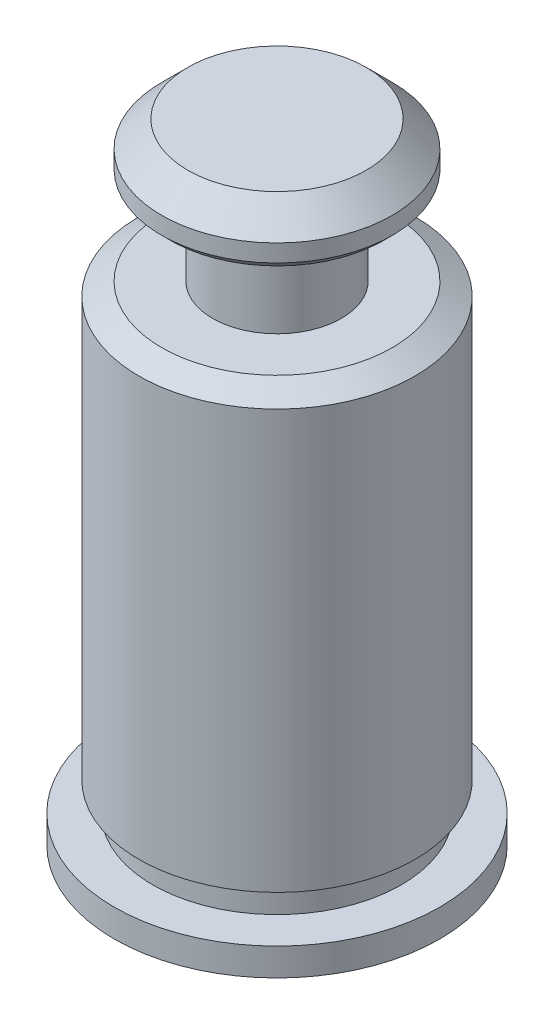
ISO-10303-21;
HEADER;
FILE_DESCRIPTION(('STEP AP214'),'2;1');
FILE_NAME('part.step','',(''),(''),'','','');
FILE_SCHEMA(('AUTOMOTIVE_DESIGN { 1 0 10303 214 1 1 1 1 }'));
ENDSEC;
DATA;
#1=APPLICATION_CONTEXT('core data for automotive mechanical design processes');
#2=APPLICATION_PROTOCOL_DEFINITION('international standard','automotive_design',2000,#1);
#3=PRODUCT_CONTEXT('',#1,'mechanical');
#4=PRODUCT('Part','Part','',(#3));
#5=PRODUCT_RELATED_PRODUCT_CATEGORY('part','',(#4));
#6=PRODUCT_DEFINITION_FORMATION('','',#4);
#7=PRODUCT_DEFINITION_CONTEXT('part definition',#1,'design');
#8=PRODUCT_DEFINITION('design','',#6,#7);
#9=PRODUCT_DEFINITION_SHAPE('','',#8);
#10=(LENGTH_UNIT() NAMED_UNIT(*) SI_UNIT(.MILLI.,.METRE.));
#11=(NAMED_UNIT(*) PLANE_ANGLE_UNIT() SI_UNIT($,.RADIAN.));
#12=(NAMED_UNIT(*) SI_UNIT($,.STERADIAN.) SOLID_ANGLE_UNIT());
#13=UNCERTAINTY_MEASURE_WITH_UNIT(LENGTH_MEASURE(1.E-05),#10,'distance_accuracy_value','');
#14=(GEOMETRIC_REPRESENTATION_CONTEXT(3) GLOBAL_UNCERTAINTY_ASSIGNED_CONTEXT((#13)) GLOBAL_UNIT_ASSIGNED_CONTEXT((#10,
#11,#12)) REPRESENTATION_CONTEXT('',''));
#15=CARTESIAN_POINT('',(0.,0.,0.));
#16=DIRECTION('',(0.,0.,1.));
#17=DIRECTION('',(1.,0.,0.));
#18=AXIS2_PLACEMENT_3D('',#15,#16,#17);
#19=CARTESIAN_POINT('',(0.,0.00507999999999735,0.));
#20=DIRECTION('',(0.,-1.,0.));
#21=DIRECTION('',(0.,0.,-1.));
#22=AXIS2_PLACEMENT_3D('',#19,#20,#21);
#23=PLANE('',#22);
#24=CARTESIAN_POINT('',(0.,0.00507999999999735,0.));
#25=DIRECTION('',(0.,-1.,0.));
#26=DIRECTION('',(0.,0.,-1.));
#27=AXIS2_PLACEMENT_3D('',#24,#25,#26);
#28=CIRCLE('',#27,2.6924);
#29=CARTESIAN_POINT('',(0.,0.00507999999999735,-2.6924));
#30=VERTEX_POINT('',#29);
#31=EDGE_CURVE('E79',#30,#30,#28,.T.);
#32=ORIENTED_EDGE('',*,*,#31,.T.);
#33=EDGE_LOOP('',(#32));
#34=FACE_BOUND('',#33,.T.);
#35=ADVANCED_FACE('F30',(#34),#23,.T.);
#36=CARTESIAN_POINT('',(1.7399,12.2682,0.));
#37=DIRECTION('',(0.,1.,0.));
#38=DIRECTION('',(0.,0.,1.));
#39=AXIS2_PLACEMENT_3D('',#36,#37,#38);
#40=PLANE('',#39);
#41=CARTESIAN_POINT('',(0.,12.2682,0.));
#42=DIRECTION('',(0.,-1.,0.));
#43=DIRECTION('',(0.,0.,-1.));
#44=AXIS2_PLACEMENT_3D('',#41,#42,#43);
#45=CIRCLE('',#44,1.7399);
#46=CARTESIAN_POINT('',(0.,12.2682,-1.7399));
#47=VERTEX_POINT('',#46);
#48=EDGE_CURVE('E10',#47,#47,#45,.T.);
#49=ORIENTED_EDGE('',*,*,#48,.F.);
#50=EDGE_LOOP('',(#49));
#51=FACE_BOUND('',#50,.T.);
#52=ADVANCED_FACE('F96',(#51),#40,.T.);
#53=CARTESIAN_POINT('',(0.,11.7602,0.));
#54=DIRECTION('',(0.,-1.,0.));
#55=DIRECTION('',(0.,0.,-1.));
#56=AXIS2_PLACEMENT_3D('',#53,#54,#55);
#57=CONICAL_SURFACE('',#56,2.2479,0.785398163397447);
#58=ORIENTED_EDGE('',*,*,#48,.T.);
#59=EDGE_LOOP('',(#58));
#60=FACE_BOUND('',#59,.T.);
#61=CARTESIAN_POINT('',(0.,11.7602,0.));
#62=DIRECTION('',(0.,-1.,0.));
#63=DIRECTION('',(0.,0.,-1.));
#64=AXIS2_PLACEMENT_3D('',#61,#62,#63);
#65=CIRCLE('',#64,2.2479);
#66=CARTESIAN_POINT('',(0.,11.7602,-2.2479));
#67=VERTEX_POINT('',#66);
#68=EDGE_CURVE('E36',#67,#67,#65,.T.);
#69=ORIENTED_EDGE('',*,*,#68,.F.);
#70=EDGE_LOOP('',(#69));
#71=FACE_BOUND('',#70,.T.);
#72=ADVANCED_FACE('F100',(#60,#71),#57,.T.);
#73=CARTESIAN_POINT('',(0.,0.,0.));
#74=DIRECTION('',(0.,-1.,0.));
#75=DIRECTION('',(0.,0.,-1.));
#76=AXIS2_PLACEMENT_3D('',#73,#74,#75);
#77=CYLINDRICAL_SURFACE('',#76,2.2479);
#78=ORIENTED_EDGE('',*,*,#68,.T.);
#79=EDGE_LOOP('',(#78));
#80=FACE_BOUND('',#79,.T.);
#81=CARTESIAN_POINT('',(0.,11.4215333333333,0.));
#82=DIRECTION('',(0.,-1.,0.));
#83=DIRECTION('',(0.,0.,-1.));
#84=AXIS2_PLACEMENT_3D('',#81,#82,#83);
#85=CIRCLE('',#84,2.2479);
#86=CARTESIAN_POINT('',(0.,11.4215333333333,-2.2479));
#87=VERTEX_POINT('',#86);
#88=EDGE_CURVE('E40',#87,#87,#85,.T.);
#89=ORIENTED_EDGE('',*,*,#88,.F.);
#90=EDGE_LOOP('',(#89));
#91=FACE_BOUND('',#90,.T.);
#92=ADVANCED_FACE('F105',(#80,#91),#77,.T.);
#93=CARTESIAN_POINT('',(0.,11.2522,0.));
#94=DIRECTION('',(0.,1.,0.));
#95=DIRECTION('',(0.,0.,1.));
#96=AXIS2_PLACEMENT_3D('',#93,#94,#95);
#97=CONICAL_SURFACE('',#96,2.07856666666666,0.785398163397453);
#98=ORIENTED_EDGE('',*,*,#88,.T.);
#99=EDGE_LOOP('',(#98));
#100=FACE_BOUND('',#99,.T.);
#101=CARTESIAN_POINT('',(0.,11.2522,0.));
#102=DIRECTION('',(0.,-1.,0.));
#103=DIRECTION('',(0.,0.,-1.));
#104=AXIS2_PLACEMENT_3D('',#101,#102,#103);
#105=CIRCLE('',#104,2.07856666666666);
#106=CARTESIAN_POINT('',(0.,11.2522,-2.07856666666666));
#107=VERTEX_POINT('',#106);
#108=EDGE_CURVE('E44',#107,#107,#105,.T.);
#109=ORIENTED_EDGE('',*,*,#108,.F.);
#110=EDGE_LOOP('',(#109));
#111=FACE_BOUND('',#110,.T.);
#112=ADVANCED_FACE('F110',(#100,#111),#97,.T.);
#113=CARTESIAN_POINT('',(1.2573,11.2522,0.));
#114=DIRECTION('',(0.,-1.,0.));
#115=DIRECTION('',(0.,0.,-1.));
#116=AXIS2_PLACEMENT_3D('',#113,#114,#115);
#117=PLANE('',#116);
#118=ORIENTED_EDGE('',*,*,#108,.T.);
#119=EDGE_LOOP('',(#118));
#120=FACE_BOUND('',#119,.T.);
#121=CARTESIAN_POINT('',(0.,11.2522,0.));
#122=DIRECTION('',(0.,-1.,0.));
#123=DIRECTION('',(0.,0.,-1.));
#124=AXIS2_PLACEMENT_3D('',#121,#122,#123);
#125=CIRCLE('',#124,1.2573);
#126=CARTESIAN_POINT('',(0.,11.2522,-1.2573));
#127=VERTEX_POINT('',#126);
#128=EDGE_CURVE('E49',#127,#127,#125,.T.);
#129=ORIENTED_EDGE('',*,*,#128,.F.);
#130=EDGE_LOOP('',(#129));
#131=FACE_BOUND('',#130,.T.);
#132=ADVANCED_FACE('F113',(#120,#131),#117,.T.);
#133=CARTESIAN_POINT('',(0.,0.,0.));
#134=DIRECTION('',(0.,-1.,0.));
#135=DIRECTION('',(0.,0.,-1.));
#136=AXIS2_PLACEMENT_3D('',#133,#134,#135);
#137=CYLINDRICAL_SURFACE('',#136,1.2573);
#138=ORIENTED_EDGE('',*,*,#128,.T.);
#139=EDGE_LOOP('',(#138));
#140=FACE_BOUND('',#139,.T.);
#141=CARTESIAN_POINT('',(0.,9.525,0.));
#142=DIRECTION('',(0.,-1.,0.));
#143=DIRECTION('',(0.,0.,-1.));
#144=AXIS2_PLACEMENT_3D('',#141,#142,#143);
#145=CIRCLE('',#144,1.2573);
#146=CARTESIAN_POINT('',(0.,9.525,-1.2573));
#147=VERTEX_POINT('',#146);
#148=EDGE_CURVE('E52',#147,#147,#145,.T.);
#149=ORIENTED_EDGE('',*,*,#148,.F.);
#150=EDGE_LOOP('',(#149));
#151=FACE_BOUND('',#150,.T.);
#152=ADVANCED_FACE('F117',(#140,#151),#137,.T.);
#153=CARTESIAN_POINT('',(2.2479,9.525,0.));
#154=DIRECTION('',(0.,1.,0.));
#155=DIRECTION('',(0.,0.,1.));
#156=AXIS2_PLACEMENT_3D('',#153,#154,#155);
#157=PLANE('',#156);
#158=ORIENTED_EDGE('',*,*,#148,.T.);
#159=EDGE_LOOP('',(#158));
#160=FACE_BOUND('',#159,.T.);
#161=CARTESIAN_POINT('',(0.,9.525,0.));
#162=DIRECTION('',(0.,-1.,0.));
#163=DIRECTION('',(0.,0.,-1.));
#164=AXIS2_PLACEMENT_3D('',#161,#162,#163);
#165=CIRCLE('',#164,2.2479);
#166=CARTESIAN_POINT('',(0.,9.525,-2.2479));
#167=VERTEX_POINT('',#166);
#168=EDGE_CURVE('E55',#167,#167,#165,.T.);
#169=ORIENTED_EDGE('',*,*,#168,.F.);
#170=EDGE_LOOP('',(#169));
#171=FACE_BOUND('',#170,.T.);
#172=ADVANCED_FACE('F121',(#160,#171),#157,.T.);
#173=CARTESIAN_POINT('',(0.,9.26836780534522,0.));
#174=DIRECTION('',(0.,-1.,0.));
#175=DIRECTION('',(0.,0.,-1.));
#176=AXIS2_PLACEMENT_3D('',#173,#174,#175);
#177=CONICAL_SURFACE('',#176,2.6924,1.0471975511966);
#178=ORIENTED_EDGE('',*,*,#168,.T.);
#179=EDGE_LOOP('',(#178));
#180=FACE_BOUND('',#179,.T.);
#181=CARTESIAN_POINT('',(0.,9.26836780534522,0.));
#182=DIRECTION('',(0.,-1.,0.));
#183=DIRECTION('',(0.,0.,-1.));
#184=AXIS2_PLACEMENT_3D('',#181,#182,#183);
#185=CIRCLE('',#184,2.6924);
#186=CARTESIAN_POINT('',(0.,9.26836780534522,-2.6924));
#187=VERTEX_POINT('',#186);
#188=EDGE_CURVE('E58',#187,#187,#185,.T.);
#189=ORIENTED_EDGE('',*,*,#188,.F.);
#190=EDGE_LOOP('',(#189));
#191=FACE_BOUND('',#190,.T.);
#192=ADVANCED_FACE('F125',(#180,#191),#177,.T.);
#193=CARTESIAN_POINT('',(0.,0.,0.));
#194=DIRECTION('',(0.,-1.,0.));
#195=DIRECTION('',(0.,0.,-1.));
#196=AXIS2_PLACEMENT_3D('',#193,#194,#195);
#197=CYLINDRICAL_SURFACE('',#196,2.6924);
#198=ORIENTED_EDGE('',*,*,#188,.T.);
#199=EDGE_LOOP('',(#198));
#200=FACE_BOUND('',#199,.T.);
#201=CARTESIAN_POINT('',(0.,1.103884,0.));
#202=DIRECTION('',(0.,-1.,0.));
#203=DIRECTION('',(0.,0.,-1.));
#204=AXIS2_PLACEMENT_3D('',#201,#202,#203);
#205=CIRCLE('',#204,2.6924);
#206=CARTESIAN_POINT('',(0.,1.103884,-2.6924));
#207=VERTEX_POINT('',#206);
#208=EDGE_CURVE('E61',#207,#207,#205,.T.);
#209=ORIENTED_EDGE('',*,*,#208,.F.);
#210=EDGE_LOOP('',(#209));
#211=FACE_BOUND('',#210,.T.);
#212=ADVANCED_FACE('F129',(#200,#211),#197,.T.);
#213=CARTESIAN_POINT('',(2.6924,1.103884,0.));
#214=DIRECTION('',(0.,-1.,0.));
#215=DIRECTION('',(0.,0.,-1.));
#216=AXIS2_PLACEMENT_3D('',#213,#214,#215);
#217=PLANE('',#216);
#218=ORIENTED_EDGE('',*,*,#208,.T.);
#219=EDGE_LOOP('',(#218));
#220=FACE_BOUND('',#219,.T.);
#221=CARTESIAN_POINT('',(0.,1.103884,0.));
#222=DIRECTION('',(0.,-1.,0.));
#223=DIRECTION('',(0.,0.,-1.));
#224=AXIS2_PLACEMENT_3D('',#221,#222,#223);
#225=CIRCLE('',#224,2.42316);
#226=CARTESIAN_POINT('',(0.,1.103884,-2.42316));
#227=VERTEX_POINT('',#226);
#228=EDGE_CURVE('E64',#227,#227,#225,.T.);
#229=ORIENTED_EDGE('',*,*,#228,.F.);
#230=EDGE_LOOP('',(#229));
#231=FACE_BOUND('',#230,.T.);
#232=ADVANCED_FACE('F133',(#220,#231),#217,.T.);
#233=CARTESIAN_POINT('',(0.,0.,0.));
#234=DIRECTION('',(0.,-1.,0.));
#235=DIRECTION('',(0.,0.,-1.));
#236=AXIS2_PLACEMENT_3D('',#233,#234,#235);
#237=CYLINDRICAL_SURFACE('',#236,2.42316);
#238=ORIENTED_EDGE('',*,*,#228,.T.);
#239=EDGE_LOOP('',(#238));
#240=FACE_BOUND('',#239,.T.);
#241=CARTESIAN_POINT('',(0.,0.53848,0.));
#242=DIRECTION('',(0.,-1.,0.));
#243=DIRECTION('',(0.,0.,-1.));
#244=AXIS2_PLACEMENT_3D('',#241,#242,#243);
#245=CIRCLE('',#244,2.42316);
#246=CARTESIAN_POINT('',(0.,0.53848,-2.42316));
#247=VERTEX_POINT('',#246);
#248=EDGE_CURVE('E67',#247,#247,#245,.T.);
#249=ORIENTED_EDGE('',*,*,#248,.F.);
#250=EDGE_LOOP('',(#249));
#251=FACE_BOUND('',#250,.T.);
#252=ADVANCED_FACE('F137',(#240,#251),#237,.T.);
#253=CARTESIAN_POINT('',(3.175,0.53848,0.));
#254=DIRECTION('',(0.,1.,0.));
#255=DIRECTION('',(0.,0.,1.));
#256=AXIS2_PLACEMENT_3D('',#253,#254,#255);
#257=PLANE('',#256);
#258=ORIENTED_EDGE('',*,*,#248,.T.);
#259=EDGE_LOOP('',(#258));
#260=FACE_BOUND('',#259,.T.);
#261=CARTESIAN_POINT('',(0.,0.53848,0.));
#262=DIRECTION('',(0.,-1.,0.));
#263=DIRECTION('',(0.,0.,-1.));
#264=AXIS2_PLACEMENT_3D('',#261,#262,#263);
#265=CIRCLE('',#264,3.175);
#266=CARTESIAN_POINT('',(0.,0.53848,-3.175));
#267=VERTEX_POINT('',#266);
#268=EDGE_CURVE('E70',#267,#267,#265,.T.);
#269=ORIENTED_EDGE('',*,*,#268,.F.);
#270=EDGE_LOOP('',(#269));
#271=FACE_BOUND('',#270,.T.);
#272=ADVANCED_FACE('F141',(#260,#271),#257,.T.);
#273=CARTESIAN_POINT('',(0.,0.,0.));
#274=DIRECTION('',(0.,-1.,0.));
#275=DIRECTION('',(0.,0.,-1.));
#276=AXIS2_PLACEMENT_3D('',#273,#274,#275);
#277=CYLINDRICAL_SURFACE('',#276,3.175);
#278=ORIENTED_EDGE('',*,*,#268,.T.);
#279=EDGE_LOOP('',(#278));
#280=FACE_BOUND('',#279,.T.);
#281=CARTESIAN_POINT('',(0.,0.,0.));
#282=DIRECTION('',(0.,-1.,0.));
#283=DIRECTION('',(0.,0.,-1.));
#284=AXIS2_PLACEMENT_3D('',#281,#282,#283);
#285=CIRCLE('',#284,3.175);
#286=CARTESIAN_POINT('',(0.,0.,-3.175));
#287=VERTEX_POINT('',#286);
#288=EDGE_CURVE('E73',#287,#287,#285,.T.);
#289=ORIENTED_EDGE('',*,*,#288,.F.);
#290=EDGE_LOOP('',(#289));
#291=FACE_BOUND('',#290,.T.);
#292=ADVANCED_FACE('F92',(#280,#291),#277,.T.);
#293=CARTESIAN_POINT('',(2.6924,0.,0.));
#294=DIRECTION('',(0.,-1.,0.));
#295=DIRECTION('',(0.,0.,-1.));
#296=AXIS2_PLACEMENT_3D('',#293,#294,#295);
#297=PLANE('',#296);
#298=ORIENTED_EDGE('',*,*,#288,.T.);
#299=EDGE_LOOP('',(#298));
#300=FACE_BOUND('',#299,.T.);
#301=CARTESIAN_POINT('',(0.,0.,0.));
#302=DIRECTION('',(0.,-1.,0.));
#303=DIRECTION('',(0.,0.,-1.));
#304=AXIS2_PLACEMENT_3D('',#301,#302,#303);
#305=CIRCLE('',#304,2.6924);
#306=CARTESIAN_POINT('',(0.,0.,-2.6924));
#307=VERTEX_POINT('',#306);
#308=EDGE_CURVE('E76',#307,#307,#305,.T.);
#309=ORIENTED_EDGE('',*,*,#308,.F.);
#310=EDGE_LOOP('',(#309));
#311=FACE_BOUND('',#310,.T.);
#312=ADVANCED_FACE('F86',(#300,#311),#297,.T.);
#313=CARTESIAN_POINT('',(0.,0.,0.));
#314=DIRECTION('',(0.,-1.,0.));
#315=DIRECTION('',(0.,0.,-1.));
#316=AXIS2_PLACEMENT_3D('',#313,#314,#315);
#317=CYLINDRICAL_SURFACE('',#316,2.6924);
#318=ORIENTED_EDGE('',*,*,#308,.T.);
#319=EDGE_LOOP('',(#318));
#320=FACE_BOUND('',#319,.T.);
#321=ORIENTED_EDGE('',*,*,#31,.F.);
#322=EDGE_LOOP('',(#321));
#323=FACE_BOUND('',#322,.T.);
#324=ADVANCED_FACE('F84',(#320,#323),#317,.F.);
#325=CLOSED_SHELL('',(#35,#52,#72,#92,#112,#132,#152,#172,#192,#212,#232,#252,#272,#292,#312,#324));
#326=MANIFOLD_SOLID_BREP('B2',#325);
#327=ADVANCED_BREP_SHAPE_REPRESENTATION('',(#18,#326),#14);
#328=SHAPE_DEFINITION_REPRESENTATION(#9,#327);
ENDSEC;
END-ISO-10303-21;
